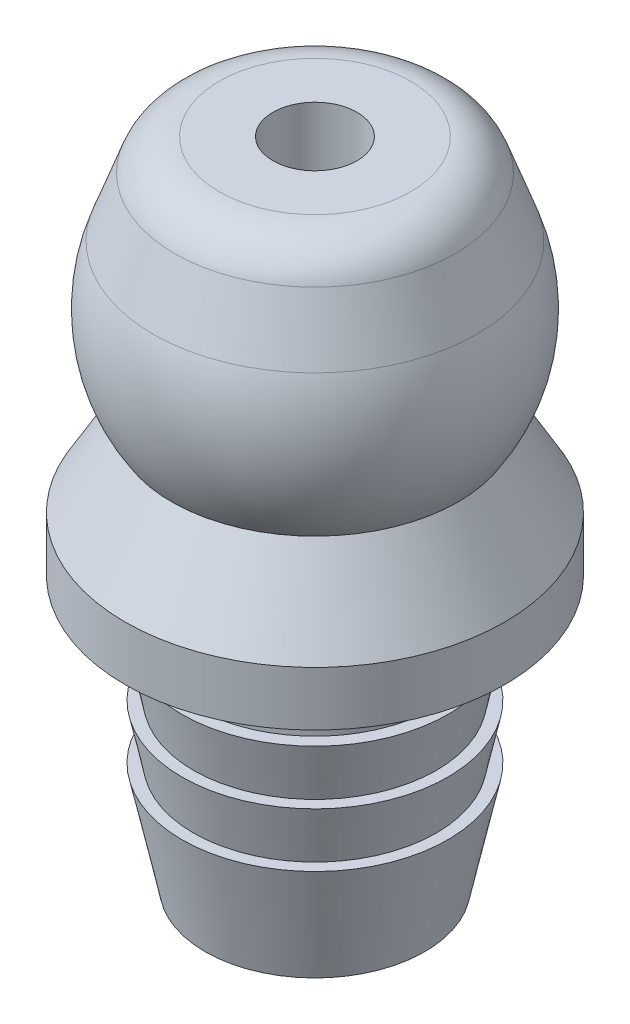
ISO-10303-21;
HEADER;
FILE_DESCRIPTION(('STEP AP214'),'2;1');
FILE_NAME('part.step','',(''),(''),'','','');
FILE_SCHEMA(('AUTOMOTIVE_DESIGN { 1 0 10303 214 1 1 1 1 }'));
ENDSEC;
DATA;
#1=APPLICATION_CONTEXT('core data for automotive mechanical design processes');
#2=APPLICATION_PROTOCOL_DEFINITION('international standard','automotive_design',2000,#1);
#3=PRODUCT_CONTEXT('',#1,'mechanical');
#4=PRODUCT('Part','Part','',(#3));
#5=PRODUCT_RELATED_PRODUCT_CATEGORY('part','',(#4));
#6=PRODUCT_DEFINITION_FORMATION('','',#4);
#7=PRODUCT_DEFINITION_CONTEXT('part definition',#1,'design');
#8=PRODUCT_DEFINITION('design','',#6,#7);
#9=PRODUCT_DEFINITION_SHAPE('','',#8);
#10=(LENGTH_UNIT() NAMED_UNIT(*) SI_UNIT(.MILLI.,.METRE.));
#11=(NAMED_UNIT(*) PLANE_ANGLE_UNIT() SI_UNIT($,.RADIAN.));
#12=(NAMED_UNIT(*) SI_UNIT($,.STERADIAN.) SOLID_ANGLE_UNIT());
#13=UNCERTAINTY_MEASURE_WITH_UNIT(LENGTH_MEASURE(1.E-05),#10,'distance_accuracy_value','');
#14=(GEOMETRIC_REPRESENTATION_CONTEXT(3) GLOBAL_UNCERTAINTY_ASSIGNED_CONTEXT((#13)) GLOBAL_UNIT_ASSIGNED_CONTEXT((#10,
#11,#12)) REPRESENTATION_CONTEXT('',''));
#15=CARTESIAN_POINT('',(0.,0.,0.));
#16=DIRECTION('',(0.,0.,1.));
#17=DIRECTION('',(1.,0.,0.));
#18=AXIS2_PLACEMENT_3D('',#15,#16,#17);
#19=CARTESIAN_POINT('',(0.7874,-1.27,0.));
#20=DIRECTION('',(0.,1.,0.));
#21=DIRECTION('',(0.,0.,1.));
#22=AXIS2_PLACEMENT_3D('',#19,#20,#21);
#23=PLANE('',#22);
#24=CARTESIAN_POINT('',(0.,-1.27,0.));
#25=DIRECTION('',(0.,1.,0.));
#26=DIRECTION('',(0.,0.,1.));
#27=AXIS2_PLACEMENT_3D('',#24,#25,#26);
#28=CIRCLE('',#27,0.889);
#29=CARTESIAN_POINT('',(0.,-1.27,0.889));
#30=VERTEX_POINT('',#29);
#31=EDGE_CURVE('E10',#30,#30,#28,.T.);
#32=ORIENTED_EDGE('',*,*,#31,.F.);
#33=EDGE_LOOP('',(#32));
#34=FACE_BOUND('',#33,.T.);
#35=CARTESIAN_POINT('',(0.,-1.27,0.));
#36=DIRECTION('',(0.,1.,0.));
#37=DIRECTION('',(0.,0.,1.));
#38=AXIS2_PLACEMENT_3D('',#35,#36,#37);
#39=CIRCLE('',#38,0.7874);
#40=CARTESIAN_POINT('',(0.,-1.27,0.7874));
#41=VERTEX_POINT('',#40);
#42=EDGE_CURVE('E418',#41,#41,#39,.T.);
#43=ORIENTED_EDGE('',*,*,#42,.T.);
#44=EDGE_LOOP('',(#43));
#45=FACE_BOUND('',#44,.T.);
#46=ADVANCED_FACE('F360',(#34,#45),#23,.F.);
#47=CARTESIAN_POINT('',(0.,0.,0.));
#48=DIRECTION('',(0.,1.,0.));
#49=DIRECTION('',(0.,0.,1.));
#50=AXIS2_PLACEMENT_3D('',#47,#48,#49);
#51=CYLINDRICAL_SURFACE('',#50,0.889000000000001);
#52=CARTESIAN_POINT('',(0.,-12.192,0.));
#53=DIRECTION('',(0.,1.,0.));
#54=DIRECTION('',(0.,0.,1.));
#55=AXIS2_PLACEMENT_3D('',#52,#53,#54);
#56=CIRCLE('',#55,0.889000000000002);
#57=CARTESIAN_POINT('',(0.,-12.192,0.889000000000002));
#58=VERTEX_POINT('',#57);
#59=EDGE_CURVE('E366',#58,#58,#56,.T.);
#60=ORIENTED_EDGE('',*,*,#59,.F.);
#61=EDGE_LOOP('',(#60));
#62=FACE_BOUND('',#61,.T.);
#63=ORIENTED_EDGE('',*,*,#31,.T.);
#64=EDGE_LOOP('',(#63));
#65=FACE_BOUND('',#64,.T.);
#66=ADVANCED_FACE('F515',(#62,#65),#51,.F.);
#67=CARTESIAN_POINT('',(0.889000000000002,-12.192,0.));
#68=DIRECTION('',(0.,1.,0.));
#69=DIRECTION('',(0.,0.,1.));
#70=AXIS2_PLACEMENT_3D('',#67,#68,#69);
#71=PLANE('',#70);
#72=CARTESIAN_POINT('',(0.,-12.192,0.));
#73=DIRECTION('',(0.,1.,0.));
#74=DIRECTION('',(0.,0.,1.));
#75=AXIS2_PLACEMENT_3D('',#72,#73,#74);
#76=CIRCLE('',#75,2.057285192);
#77=CARTESIAN_POINT('',(0.,-12.192,2.057285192));
#78=VERTEX_POINT('',#77);
#79=EDGE_CURVE('E370',#78,#78,#76,.T.);
#80=ORIENTED_EDGE('',*,*,#79,.F.);
#81=EDGE_LOOP('',(#80));
#82=FACE_BOUND('',#81,.T.);
#83=ORIENTED_EDGE('',*,*,#59,.T.);
#84=EDGE_LOOP('',(#83));
#85=FACE_BOUND('',#84,.T.);
#86=ADVANCED_FACE('F510',(#82,#85),#71,.F.);
#87=CARTESIAN_POINT('',(0.,-12.192,0.));
#88=DIRECTION('',(0.,1.,0.));
#89=DIRECTION('',(0.,0.,1.));
#90=AXIS2_PLACEMENT_3D('',#87,#88,#89);
#91=CONICAL_SURFACE('',#90,2.057285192,0.209439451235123);
#92=CARTESIAN_POINT('',(0.,-10.16,0.));
#93=DIRECTION('',(0.,1.,0.));
#94=DIRECTION('',(0.,0.,1.));
#95=AXIS2_PLACEMENT_3D('',#92,#93,#94);
#96=CIRCLE('',#95,2.4892);
#97=CARTESIAN_POINT('',(0.,-10.16,2.4892));
#98=VERTEX_POINT('',#97);
#99=EDGE_CURVE('E374',#98,#98,#96,.T.);
#100=ORIENTED_EDGE('',*,*,#99,.F.);
#101=EDGE_LOOP('',(#100));
#102=FACE_BOUND('',#101,.T.);
#103=ORIENTED_EDGE('',*,*,#79,.T.);
#104=EDGE_LOOP('',(#103));
#105=FACE_BOUND('',#104,.T.);
#106=ADVANCED_FACE('F504',(#102,#105),#91,.T.);
#107=CARTESIAN_POINT('',(2.4892,-10.16,0.));
#108=DIRECTION('',(0.,-1.,0.));
#109=DIRECTION('',(0.,0.,-1.));
#110=AXIS2_PLACEMENT_3D('',#107,#108,#109);
#111=PLANE('',#110);
#112=CARTESIAN_POINT('',(0.,-10.16,0.));
#113=DIRECTION('',(0.,1.,0.));
#114=DIRECTION('',(0.,0.,1.));
#115=AXIS2_PLACEMENT_3D('',#112,#113,#114);
#116=CIRCLE('',#115,2.273242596);
#117=CARTESIAN_POINT('',(0.,-10.16,2.273242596));
#118=VERTEX_POINT('',#117);
#119=EDGE_CURVE('E379',#118,#118,#116,.T.);
#120=ORIENTED_EDGE('',*,*,#119,.F.);
#121=EDGE_LOOP('',(#120));
#122=FACE_BOUND('',#121,.T.);
#123=ORIENTED_EDGE('',*,*,#99,.T.);
#124=EDGE_LOOP('',(#123));
#125=FACE_BOUND('',#124,.T.);
#126=ADVANCED_FACE('F498',(#122,#125),#111,.F.);
#127=CARTESIAN_POINT('',(0.,-10.16,0.));
#128=DIRECTION('',(0.,1.,0.));
#129=DIRECTION('',(0.,0.,1.));
#130=AXIS2_PLACEMENT_3D('',#127,#128,#129);
#131=CONICAL_SURFACE('',#130,2.273242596,0.209439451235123);
#132=CARTESIAN_POINT('',(0.,-9.144,0.));
#133=DIRECTION('',(0.,1.,0.));
#134=DIRECTION('',(0.,0.,1.));
#135=AXIS2_PLACEMENT_3D('',#132,#133,#134);
#136=CIRCLE('',#135,2.4892);
#137=CARTESIAN_POINT('',(0.,-9.144,2.4892));
#138=VERTEX_POINT('',#137);
#139=EDGE_CURVE('E382',#138,#138,#136,.T.);
#140=ORIENTED_EDGE('',*,*,#139,.F.);
#141=EDGE_LOOP('',(#140));
#142=FACE_BOUND('',#141,.T.);
#143=ORIENTED_EDGE('',*,*,#119,.T.);
#144=EDGE_LOOP('',(#143));
#145=FACE_BOUND('',#144,.T.);
#146=ADVANCED_FACE('F492',(#142,#145),#131,.T.);
#147=CARTESIAN_POINT('',(2.4892,-9.144,0.));
#148=DIRECTION('',(0.,-1.,0.));
#149=DIRECTION('',(0.,0.,-1.));
#150=AXIS2_PLACEMENT_3D('',#147,#148,#149);
#151=PLANE('',#150);
#152=CARTESIAN_POINT('',(0.,-9.144,0.));
#153=DIRECTION('',(0.,1.,0.));
#154=DIRECTION('',(0.,0.,1.));
#155=AXIS2_PLACEMENT_3D('',#152,#153,#154);
#156=CIRCLE('',#155,2.273242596);
#157=CARTESIAN_POINT('',(0.,-9.144,2.273242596));
#158=VERTEX_POINT('',#157);
#159=EDGE_CURVE('E385',#158,#158,#156,.T.);
#160=ORIENTED_EDGE('',*,*,#159,.F.);
#161=EDGE_LOOP('',(#160));
#162=FACE_BOUND('',#161,.T.);
#163=ORIENTED_EDGE('',*,*,#139,.T.);
#164=EDGE_LOOP('',(#163));
#165=FACE_BOUND('',#164,.T.);
#166=ADVANCED_FACE('F486',(#162,#165),#151,.F.);
#167=CARTESIAN_POINT('',(0.,-9.144,0.));
#168=DIRECTION('',(0.,1.,0.));
#169=DIRECTION('',(0.,0.,1.));
#170=AXIS2_PLACEMENT_3D('',#167,#168,#169);
#171=CONICAL_SURFACE('',#170,2.273242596,0.209439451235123);
#172=CARTESIAN_POINT('',(0.,-8.128,0.));
#173=DIRECTION('',(0.,1.,0.));
#174=DIRECTION('',(0.,0.,1.));
#175=AXIS2_PLACEMENT_3D('',#172,#173,#174);
#176=CIRCLE('',#175,2.4892);
#177=CARTESIAN_POINT('',(0.,-8.128,2.4892));
#178=VERTEX_POINT('',#177);
#179=EDGE_CURVE('E388',#178,#178,#176,.T.);
#180=ORIENTED_EDGE('',*,*,#179,.F.);
#181=EDGE_LOOP('',(#180));
#182=FACE_BOUND('',#181,.T.);
#183=ORIENTED_EDGE('',*,*,#159,.T.);
#184=EDGE_LOOP('',(#183));
#185=FACE_BOUND('',#184,.T.);
#186=ADVANCED_FACE('F480',(#182,#185),#171,.T.);
#187=CARTESIAN_POINT('',(2.4892,-8.128,0.));
#188=DIRECTION('',(0.,-1.,0.));
#189=DIRECTION('',(0.,0.,-1.));
#190=AXIS2_PLACEMENT_3D('',#187,#188,#189);
#191=PLANE('',#190);
#192=CARTESIAN_POINT('',(0.,-8.128,0.));
#193=DIRECTION('',(0.,1.,0.));
#194=DIRECTION('',(0.,0.,1.));
#195=AXIS2_PLACEMENT_3D('',#192,#193,#194);
#196=CIRCLE('',#195,2.2606);
#197=CARTESIAN_POINT('',(0.,-8.128,2.2606));
#198=VERTEX_POINT('',#197);
#199=EDGE_CURVE('E391',#198,#198,#196,.T.);
#200=ORIENTED_EDGE('',*,*,#199,.F.);
#201=EDGE_LOOP('',(#200));
#202=FACE_BOUND('',#201,.T.);
#203=ORIENTED_EDGE('',*,*,#179,.T.);
#204=EDGE_LOOP('',(#203));
#205=FACE_BOUND('',#204,.T.);
#206=ADVANCED_FACE('F474',(#202,#205),#191,.F.);
#207=CARTESIAN_POINT('',(0.,0.,0.));
#208=DIRECTION('',(0.,1.,0.));
#209=DIRECTION('',(0.,0.,1.));
#210=AXIS2_PLACEMENT_3D('',#207,#208,#209);
#211=CYLINDRICAL_SURFACE('',#210,2.2606);
#212=CARTESIAN_POINT('',(0.,-7.112,0.));
#213=DIRECTION('',(0.,1.,0.));
#214=DIRECTION('',(0.,0.,1.));
#215=AXIS2_PLACEMENT_3D('',#212,#213,#214);
#216=CIRCLE('',#215,2.2606);
#217=CARTESIAN_POINT('',(0.,-7.112,2.2606));
#218=VERTEX_POINT('',#217);
#219=EDGE_CURVE('E394',#218,#218,#216,.T.);
#220=ORIENTED_EDGE('',*,*,#219,.F.);
#221=EDGE_LOOP('',(#220));
#222=FACE_BOUND('',#221,.T.);
#223=ORIENTED_EDGE('',*,*,#199,.T.);
#224=EDGE_LOOP('',(#223));
#225=FACE_BOUND('',#224,.T.);
#226=ADVANCED_FACE('F468',(#222,#225),#211,.T.);
#227=CARTESIAN_POINT('',(2.2606,-7.112,0.));
#228=DIRECTION('',(0.,1.,0.));
#229=DIRECTION('',(0.,0.,1.));
#230=AXIS2_PLACEMENT_3D('',#227,#228,#229);
#231=PLANE('',#230);
#232=CARTESIAN_POINT('',(0.,-7.112,0.));
#233=DIRECTION('',(0.,1.,0.));
#234=DIRECTION('',(0.,0.,1.));
#235=AXIS2_PLACEMENT_3D('',#232,#233,#234);
#236=CIRCLE('',#235,3.556);
#237=CARTESIAN_POINT('',(0.,-7.112,3.556));
#238=VERTEX_POINT('',#237);
#239=EDGE_CURVE('E397',#238,#238,#236,.T.);
#240=ORIENTED_EDGE('',*,*,#239,.F.);
#241=EDGE_LOOP('',(#240));
#242=FACE_BOUND('',#241,.T.);
#243=ORIENTED_EDGE('',*,*,#219,.T.);
#244=EDGE_LOOP('',(#243));
#245=FACE_BOUND('',#244,.T.);
#246=ADVANCED_FACE('F462',(#242,#245),#231,.F.);
#247=CARTESIAN_POINT('',(0.,0.,0.));
#248=DIRECTION('',(0.,1.,0.));
#249=DIRECTION('',(0.,0.,1.));
#250=AXIS2_PLACEMENT_3D('',#247,#248,#249);
#251=CYLINDRICAL_SURFACE('',#250,3.556);
#252=CARTESIAN_POINT('',(0.,-6.096,0.));
#253=DIRECTION('',(0.,1.,0.));
#254=DIRECTION('',(0.,0.,1.));
#255=AXIS2_PLACEMENT_3D('',#252,#253,#254);
#256=CIRCLE('',#255,3.556);
#257=CARTESIAN_POINT('',(0.,-6.096,3.556));
#258=VERTEX_POINT('',#257);
#259=EDGE_CURVE('E400',#258,#258,#256,.T.);
#260=ORIENTED_EDGE('',*,*,#259,.F.);
#261=EDGE_LOOP('',(#260));
#262=FACE_BOUND('',#261,.T.);
#263=ORIENTED_EDGE('',*,*,#239,.T.);
#264=EDGE_LOOP('',(#263));
#265=FACE_BOUND('',#264,.T.);
#266=ADVANCED_FACE('F456',(#262,#265),#251,.T.);
#267=CARTESIAN_POINT('',(0.,-6.096,0.));
#268=DIRECTION('',(0.,-1.,0.));
#269=DIRECTION('',(0.,0.,-1.));
#270=AXIS2_PLACEMENT_3D('',#267,#268,#269);
#271=CONICAL_SURFACE('',#270,3.556,0.523598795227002);
#272=CARTESIAN_POINT('',(0.,-4.584441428,0.));
#273=DIRECTION('',(0.,1.,0.));
#274=DIRECTION('',(0.,0.,1.));
#275=AXIS2_PLACEMENT_3D('',#272,#273,#274);
#276=CIRCLE('',#275,2.683301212);
#277=CARTESIAN_POINT('',(2.683301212,-4.584441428,0.));
#278=VERTEX_POINT('',#277);
#279=EDGE_CURVE('E403',#278,#278,#276,.T.);
#280=ORIENTED_EDGE('',*,*,#279,.F.);
#281=EDGE_LOOP('',(#280));
#282=FACE_BOUND('',#281,.T.);
#283=ORIENTED_EDGE('',*,*,#259,.T.);
#284=EDGE_LOOP('',(#283));
#285=FACE_BOUND('',#284,.T.);
#286=ADVANCED_FACE('F450',(#282,#285),#271,.T.);
#287=CARTESIAN_POINT('',(-6.40697567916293E-07,-2.79400000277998,0.));
#288=DIRECTION('',(0.,1.,0.));
#289=DIRECTION('',(1.,0.,0.));
#290=AXIS2_PLACEMENT_3D('',#287,#288,#289);
#291=SPHERICAL_SURFACE('',#290,3.22580057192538);
#292=CARTESIAN_POINT('',(0.,-1.69071122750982,0.));
#293=DIRECTION('',(0.,1.,0.));
#294=DIRECTION('',(0.,0.,1.));
#295=AXIS2_PLACEMENT_3D('',#292,#293,#294);
#296=CIRCLE('',#295,3.03126035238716);
#297=CARTESIAN_POINT('',(3.03126035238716,-1.69071122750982,0.));
#298=VERTEX_POINT('',#297);
#299=EDGE_CURVE('E406',#298,#298,#296,.T.);
#300=CARTESIAN_POINT('',(3.03126035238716,-1.69071122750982,0.));
#301=CARTESIAN_POINT('',(3.04203449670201,-1.72031253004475,0.));
#302=CARTESIAN_POINT('',(3.05237477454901,-1.75007173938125,0.));
#303=CARTESIAN_POINT('',(3.07217931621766,-1.80988023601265,0.));
#304=CARTESIAN_POINT('',(3.08164358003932,-1.83992952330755,0.));
#305=CARTESIAN_POINT('',(3.09968781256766,-1.90029244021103,0.));
#306=CARTESIAN_POINT('',(3.10826778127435,-1.93060606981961,0.));
#307=CARTESIAN_POINT('',(3.1245361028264,-1.99147164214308,0.));
#308=CARTESIAN_POINT('',(3.13222445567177,-2.02202358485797,0.));
#309=CARTESIAN_POINT('',(3.14670293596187,-2.08333956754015,0.));
#310=CARTESIAN_POINT('',(3.1534930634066,-2.11410360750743,0.));
#311=CARTESIAN_POINT('',(3.1661692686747,-2.1758173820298,0.));
#312=CARTESIAN_POINT('',(3.17205534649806,-2.20676711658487,0.));
#313=CARTESIAN_POINT('',(3.18291840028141,-2.26882571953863,0.));
#314=CARTESIAN_POINT('',(3.18789537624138,-2.29993458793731,0.));
#315=CARTESIAN_POINT('',(3.19693595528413,-2.36228476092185,0.));
#316=CARTESIAN_POINT('',(3.20099955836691,-2.3935260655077,0.));
#317=CARTESIAN_POINT('',(3.20820990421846,-2.45611429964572,0.));
#318=CARTESIAN_POINT('',(3.21135664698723,-2.48746122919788,0.));
#319=CARTESIAN_POINT('',(3.21673057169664,-2.55023381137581,0.));
#320=CARTESIAN_POINT('',(3.21895775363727,-2.58165946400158,0.));
#321=CARTESIAN_POINT('',(3.22249064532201,-2.64456252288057,0.));
#322=CARTESIAN_POINT('',(3.22379635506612,-2.6760399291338,0.));
#323=CARTESIAN_POINT('',(3.2254851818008,-2.73901948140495,0.));
#324=CARTESIAN_POINT('',(3.22586829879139,-2.77052162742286,0.));
#325=CARTESIAN_POINT('',(3.2257116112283,-2.83352362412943,0.));
#326=CARTESIAN_POINT('',(3.22517180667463,-2.86502347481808,0.));
#327=CARTESIAN_POINT('',(3.22316973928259,-2.92799384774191,0.));
#328=CARTESIAN_POINT('',(3.2217074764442,-2.95946436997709,0.));
#329=CARTESIAN_POINT('',(3.21786174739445,-3.02234907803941,0.));
#330=CARTESIAN_POINT('',(3.21547828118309,-3.05376326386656,0.));
#331=CARTESIAN_POINT('',(3.20979219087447,-3.11650833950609,0.));
#332=CARTESIAN_POINT('',(3.20648956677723,-3.14783922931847,0.));
#333=CARTESIAN_POINT('',(3.19896799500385,-3.21039082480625,0.));
#334=CARTESIAN_POINT('',(3.19474904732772,-3.24161153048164,0.));
#335=CARTESIAN_POINT('',(3.1853984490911,-3.30391596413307,0.));
#336=CARTESIAN_POINT('',(3.1802667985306,-3.33499969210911,0.));
#337=CARTESIAN_POINT('',(3.16909519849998,-3.39700349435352,0.));
#338=CARTESIAN_POINT('',(3.16305524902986,-3.42792356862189,0.));
#339=CARTESIAN_POINT('',(3.1500722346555,-3.48957352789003,0.));
#340=CARTESIAN_POINT('',(3.14312916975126,-3.5203034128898,0.));
#341=CARTESIAN_POINT('',(3.12834588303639,-3.5815466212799,0.));
#342=CARTESIAN_POINT('',(3.12050566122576,-3.61205994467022,0.));
#343=CARTESIAN_POINT('',(3.10393478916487,-3.67284384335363,0.));
#344=CARTESIAN_POINT('',(3.09520413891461,-3.70311441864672,0.));
#345=CARTESIAN_POINT('',(3.07685990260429,-3.76338684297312,0.));
#346=CARTESIAN_POINT('',(3.06724631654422,-3.79338869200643,0.));
#347=CARTESIAN_POINT('',(3.04714445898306,-3.85309791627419,0.));
#348=CARTESIAN_POINT('',(3.03665618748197,-3.88280529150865,0.));
#349=CARTESIAN_POINT('',(3.01481396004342,-3.94190007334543,0.));
#350=CARTESIAN_POINT('',(3.00346000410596,-3.97128747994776,0.));
#351=CARTESIAN_POINT('',(2.97989615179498,-4.02971710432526,0.));
#352=CARTESIAN_POINT('',(2.96768625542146,-4.05875932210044,0.));
#353=CARTESIAN_POINT('',(2.94242100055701,-4.11647364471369,0.));
#354=CARTESIAN_POINT('',(2.92936564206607,-4.14514574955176,0.));
#355=CARTESIAN_POINT('',(2.90242066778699,-4.20209524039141,0.));
#356=CARTESIAN_POINT('',(2.88853105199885,-4.23037262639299,0.));
#357=CARTESIAN_POINT('',(2.85992948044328,-4.28650841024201,0.));
#358=CARTESIAN_POINT('',(2.84521752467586,-4.31436680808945,0.));
#359=CARTESIAN_POINT('',(2.8149839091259,-4.36964071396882,0.));
#360=CARTESIAN_POINT('',(2.79946224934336,-4.39705622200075,0.));
#361=CARTESIAN_POINT('',(2.7676225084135,-4.45142079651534,0.));
#362=CARTESIAN_POINT('',(2.75130442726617,-4.478369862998,0.));
#363=CARTESIAN_POINT('',(2.71788598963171,-4.5317785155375,0.));
#364=CARTESIAN_POINT('',(2.70078563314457,-4.55823810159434,0.));
#365=CARTESIAN_POINT('',(2.683301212,-4.584441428,0.));
#366=B_SPLINE_CURVE_WITH_KNOTS('',3,(#300,#301,#302,#303,#304,#305,#306,#307,#308,#309,#310,
#311,#312,#313,#314,#315,#316,#317,#318,#319,#320,#321,#322,#323,#324,#325,#326,#327,#328,#329,
#330,#331,#332,#333,#334,#335,#336,#337,#338,#339,#340,#341,#342,#343,#344,#345,#346,#347,#348,
#349,#350,#351,#352,#353,#354,#355,#356,#357,#358,#359,#360,#361,#362,#363,#364,#365),
.UNSPECIFIED.,.F.,.F.,(4,2,2,2,2,2,2,2,2,2,2,2,2,2,2,2,2,2,2,2,2,2,2,2,2,2,2,2,2,2,2,2,4),(0.,
0.0944999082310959,0.188999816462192,0.283499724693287,0.377999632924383,0.472499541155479,
0.566999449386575,0.66149935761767,0.755999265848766,0.850499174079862,0.944999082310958,
1.03949899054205,1.13399889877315,1.22849880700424,1.32299871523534,1.41749862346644,
1.51199853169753,1.60649843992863,1.70099834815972,1.79549825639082,1.88999816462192,
1.98449807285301,2.07899798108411,2.1734978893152,2.2679977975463,2.36249770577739,
2.45699761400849,2.55149752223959,2.64599743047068,2.74049733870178,2.83499724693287,
2.92949715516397,3.02399706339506),.UNSPECIFIED.);
#367=EDGE_CURVE('BSEAM444',#298,#278,#366,.T.);
#368=ORIENTED_EDGE('',*,*,#299,.F.);
#369=ORIENTED_EDGE('',*,*,#279,.T.);
#370=ORIENTED_EDGE('',*,*,#367,.T.);
#371=ORIENTED_EDGE('',*,*,#367,.F.);
#372=EDGE_LOOP('',(#368,#370,#369,#371));
#373=FACE_BOUND('',#372,.T.);
#374=ADVANCED_FACE('F444',(#373),#291,.T.);
#375=CARTESIAN_POINT('',(0.,-1.69071122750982,0.));
#376=DIRECTION('',(0.,-1.,0.));
#377=DIRECTION('',(0.,0.,-1.));
#378=AXIS2_PLACEMENT_3D('',#375,#376,#377);
#379=CONICAL_SURFACE('',#378,3.03126035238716,0.349065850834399);
#380=CARTESIAN_POINT('',(0.,-0.584944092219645,0.));
#381=DIRECTION('',(0.,1.,0.));
#382=DIRECTION('',(0.,0.,1.));
#383=AXIS2_PLACEMENT_3D('',#380,#381,#382);
#384=CIRCLE('',#383,2.62879402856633);
#385=CARTESIAN_POINT('',(0.,-0.584944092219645,2.62879402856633));
#386=VERTEX_POINT('',#385);
#387=EDGE_CURVE('E409',#386,#386,#384,.T.);
#388=ORIENTED_EDGE('',*,*,#387,.F.);
#389=EDGE_LOOP('',(#388));
#390=FACE_BOUND('',#389,.T.);
#391=ORIENTED_EDGE('',*,*,#299,.T.);
#392=EDGE_LOOP('',(#391));
#393=FACE_BOUND('',#392,.T.);
#394=ADVANCED_FACE('F438',(#390,#393),#379,.T.);
#395=CARTESIAN_POINT('',(0.,-0.889,0.));
#396=DIRECTION('',(0.,1.,0.));
#397=DIRECTION('',(0.,0.,1.));
#398=AXIS2_PLACEMENT_3D('',#395,#396,#397);
#399=TOROIDAL_SURFACE('',#398,1.79340728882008,0.889);
#400=CARTESIAN_POINT('',(0.,0.,0.));
#401=DIRECTION('',(0.,1.,0.));
#402=DIRECTION('',(0.,0.,1.));
#403=AXIS2_PLACEMENT_3D('',#400,#401,#402);
#404=CIRCLE('',#403,1.79340728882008);
#405=CARTESIAN_POINT('',(0.,0.,1.79340728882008));
#406=VERTEX_POINT('',#405);
#407=EDGE_CURVE('E412',#406,#406,#404,.T.);
#408=ORIENTED_EDGE('',*,*,#407,.F.);
#409=EDGE_LOOP('',(#408));
#410=FACE_BOUND('',#409,.T.);
#411=ORIENTED_EDGE('',*,*,#387,.T.);
#412=EDGE_LOOP('',(#411));
#413=FACE_BOUND('',#412,.T.);
#414=ADVANCED_FACE('F432',(#410,#413),#399,.T.);
#415=CARTESIAN_POINT('',(1.79340728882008,0.,0.));
#416=DIRECTION('',(0.,-1.,0.));
#417=DIRECTION('',(0.,0.,-1.));
#418=AXIS2_PLACEMENT_3D('',#415,#416,#417);
#419=PLANE('',#418);
#420=CARTESIAN_POINT('',(0.,0.,0.));
#421=DIRECTION('',(0.,1.,0.));
#422=DIRECTION('',(0.,0.,1.));
#423=AXIS2_PLACEMENT_3D('',#420,#421,#422);
#424=CIRCLE('',#423,0.7874);
#425=CARTESIAN_POINT('',(0.,0.,0.7874));
#426=VERTEX_POINT('',#425);
#427=EDGE_CURVE('E415',#426,#426,#424,.T.);
#428=ORIENTED_EDGE('',*,*,#427,.F.);
#429=EDGE_LOOP('',(#428));
#430=FACE_BOUND('',#429,.T.);
#431=ORIENTED_EDGE('',*,*,#407,.T.);
#432=EDGE_LOOP('',(#431));
#433=FACE_BOUND('',#432,.T.);
#434=ADVANCED_FACE('F426',(#430,#433),#419,.F.);
#435=CARTESIAN_POINT('',(0.,0.,0.));
#436=DIRECTION('',(0.,1.,0.));
#437=DIRECTION('',(0.,0.,1.));
#438=AXIS2_PLACEMENT_3D('',#435,#436,#437);
#439=CYLINDRICAL_SURFACE('',#438,0.7874);
#440=ORIENTED_EDGE('',*,*,#42,.F.);
#441=EDGE_LOOP('',(#440));
#442=FACE_BOUND('',#441,.T.);
#443=ORIENTED_EDGE('',*,*,#427,.T.);
#444=EDGE_LOOP('',(#443));
#445=FACE_BOUND('',#444,.T.);
#446=ADVANCED_FACE('F423',(#442,#445),#439,.F.);
#447=CLOSED_SHELL('',(#46,#66,#86,#106,#126,#146,#166,#186,#206,#226,#246,#266,#286,#374,#394,
#414,#434,#446));
#448=MANIFOLD_SOLID_BREP('B2',#447);
#449=ADVANCED_BREP_SHAPE_REPRESENTATION('',(#18,#448),#14);
#450=SHAPE_DEFINITION_REPRESENTATION(#9,#449);
ENDSEC;
END-ISO-10303-21;
